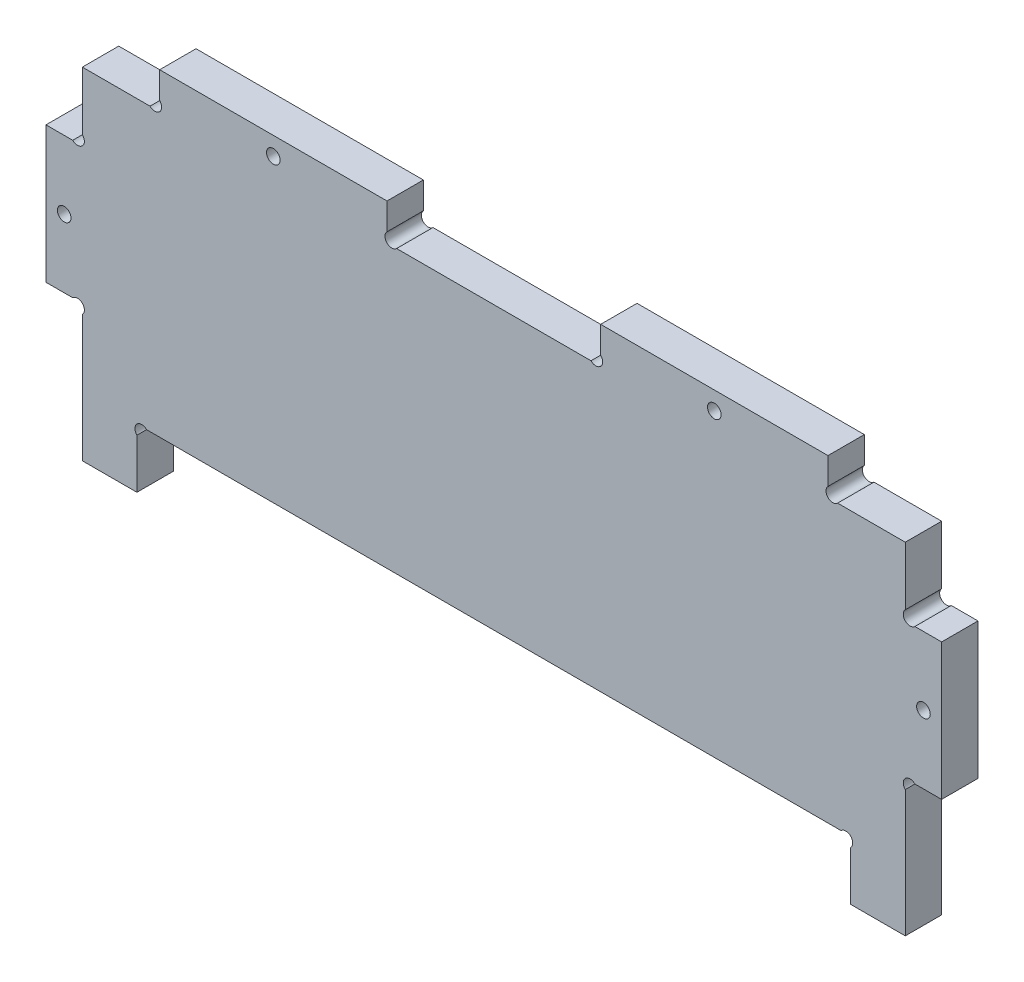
ISO-10303-21;
HEADER;
FILE_DESCRIPTION(('STEP AP214'),'2;1');
FILE_NAME('part.step','',(''),(''),'','','');
FILE_SCHEMA(('AUTOMOTIVE_DESIGN { 1 0 10303 214 1 1 1 1 }'));
ENDSEC;
DATA;
#1=APPLICATION_CONTEXT('core data for automotive mechanical design processes');
#2=APPLICATION_PROTOCOL_DEFINITION('international standard','automotive_design',2000,#1);
#3=PRODUCT_CONTEXT('',#1,'mechanical');
#4=PRODUCT('Part','Part','',(#3));
#5=PRODUCT_RELATED_PRODUCT_CATEGORY('part','',(#4));
#6=PRODUCT_DEFINITION_FORMATION('','',#4);
#7=PRODUCT_DEFINITION_CONTEXT('part definition',#1,'design');
#8=PRODUCT_DEFINITION('design','',#6,#7);
#9=PRODUCT_DEFINITION_SHAPE('','',#8);
#10=(LENGTH_UNIT() NAMED_UNIT(*) SI_UNIT(.MILLI.,.METRE.));
#11=(NAMED_UNIT(*) PLANE_ANGLE_UNIT() SI_UNIT($,.RADIAN.));
#12=(NAMED_UNIT(*) SI_UNIT($,.STERADIAN.) SOLID_ANGLE_UNIT());
#13=UNCERTAINTY_MEASURE_WITH_UNIT(LENGTH_MEASURE(1.E-05),#10,'distance_accuracy_value','');
#14=(GEOMETRIC_REPRESENTATION_CONTEXT(3) GLOBAL_UNCERTAINTY_ASSIGNED_CONTEXT((#13)) GLOBAL_UNIT_ASSIGNED_CONTEXT((#10,
#11,#12)) REPRESENTATION_CONTEXT('',''));
#15=CARTESIAN_POINT('',(0.,0.,0.));
#16=DIRECTION('',(0.,0.,1.));
#17=DIRECTION('',(1.,0.,0.));
#18=AXIS2_PLACEMENT_3D('',#15,#16,#17);
#19=CARTESIAN_POINT('',(146.896258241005,11.5239492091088,8.));
#20=DIRECTION('',(0.,0.,1.));
#21=DIRECTION('',(1.,0.,0.));
#22=AXIS2_PLACEMENT_3D('',#19,#20,#21);
#23=PLANE('',#22);
#24=CARTESIAN_POINT('',(103.835598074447,29.4632890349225,8.));
#25=DIRECTION('',(0.,0.,1.));
#26=DIRECTION('',(1.,0.,0.));
#27=AXIS2_PLACEMENT_3D('',#24,#25,#26);
#28=CIRCLE('',#27,1.5);
#29=CARTESIAN_POINT('',(105.335598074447,29.4632890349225,8.));
#30=VERTEX_POINT('',#29);
#31=EDGE_CURVE('E580',#30,#30,#28,.T.);
#32=ORIENTED_EDGE('',*,*,#31,.F.);
#33=EDGE_LOOP('',(#32));
#34=FACE_BOUND('',#33,.T.);
#35=CARTESIAN_POINT('',(-39.1644019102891,-4.53671096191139,8.));
#36=DIRECTION('',(0.,0.,1.));
#37=DIRECTION('',(-1.,0.,0.));
#38=AXIS2_PLACEMENT_3D('',#35,#36,#37);
#39=CIRCLE('',#38,1.5);
#40=CARTESIAN_POINT('',(-40.6644019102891,-4.53671096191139,8.));
#41=VERTEX_POINT('',#40);
#42=EDGE_CURVE('E289',#41,#41,#39,.T.);
#43=ORIENTED_EDGE('',*,*,#42,.F.);
#44=EDGE_LOOP('',(#43));
#45=FACE_BOUND('',#44,.T.);
#46=CARTESIAN_POINT('',(146.896258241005,11.5239492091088,8.));
#47=DIRECTION('',(0.,0.,-1.));
#48=DIRECTION('',(1.,0.,0.));
#49=AXIS2_PLACEMENT_3D('',#46,#47,#48);
#50=CIRCLE('',#49,1.49999999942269);
#51=CARTESIAN_POINT('',(147.956918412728,10.4632890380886,8.));
#52=VERTEX_POINT('',#51);
#53=CARTESIAN_POINT('',(145.835598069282,12.584609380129,8.));
#54=VERTEX_POINT('',#53);
#55=EDGE_CURVE('E356',#52,#54,#50,.T.);
#56=ORIENTED_EDGE('',*,*,#55,.T.);
#57=DIRECTION('',(0.,1.,0.));
#58=VECTOR('',#57,1.);
#59=CARTESIAN_POINT('',(145.835598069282,12.584609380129,8.));
#60=LINE('',#59,#58);
#61=CARTESIAN_POINT('',(145.835598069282,25.4632890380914,8.));
#62=VERTEX_POINT('',#61);
#63=EDGE_CURVE('E170',#54,#62,#60,.T.);
#64=ORIENTED_EDGE('',*,*,#63,.T.);
#65=DIRECTION('',(-1.,0.,0.));
#66=VECTOR('',#65,1.);
#67=CARTESIAN_POINT('',(130.956918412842,25.4632890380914,8.));
#68=LINE('',#67,#66);
#69=CARTESIAN_POINT('',(130.956918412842,25.4632890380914,8.));
#70=VERTEX_POINT('',#69);
#71=EDGE_CURVE('E449',#62,#70,#68,.T.);
#72=ORIENTED_EDGE('',*,*,#71,.T.);
#73=CARTESIAN_POINT('',(129.896258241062,26.5239492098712,8.));
#74=DIRECTION('',(0.,0.,-1.));
#75=DIRECTION('',(1.,0.,0.));
#76=AXIS2_PLACEMENT_3D('',#73,#74,#75);
#77=CIRCLE('',#76,1.49999999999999);
#78=CARTESIAN_POINT('',(128.835598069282,27.584609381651,8.));
#79=VERTEX_POINT('',#78);
#80=EDGE_CURVE('E468',#70,#79,#77,.T.);
#81=ORIENTED_EDGE('',*,*,#80,.T.);
#82=DIRECTION('',(0.,1.,0.));
#83=VECTOR('',#82,1.);
#84=CARTESIAN_POINT('',(128.835598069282,33.4632890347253,8.));
#85=LINE('',#84,#83);
#86=CARTESIAN_POINT('',(128.835598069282,33.4632890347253,8.));
#87=VERTEX_POINT('',#86);
#88=EDGE_CURVE('E465',#79,#87,#85,.T.);
#89=ORIENTED_EDGE('',*,*,#88,.T.);
#90=DIRECTION('',(-1.,0.,0.));
#91=VECTOR('',#90,1.);
#92=CARTESIAN_POINT('',(78.8355980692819,33.4632890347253,8.));
#93=LINE('',#92,#91);
#94=CARTESIAN_POINT('',(78.8355980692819,33.4632890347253,8.));
#95=VERTEX_POINT('',#94);
#96=EDGE_CURVE('E467',#87,#95,#93,.T.);
#97=ORIENTED_EDGE('',*,*,#96,.T.);
#98=DIRECTION('',(0.,-1.,0.));
#99=VECTOR('',#98,1.);
#100=CARTESIAN_POINT('',(78.8355980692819,27.5846093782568,8.));
#101=LINE('',#100,#99);
#102=CARTESIAN_POINT('',(78.8355980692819,27.5846093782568,8.));
#103=VERTEX_POINT('',#102);
#104=EDGE_CURVE('E470',#95,#103,#101,.T.);
#105=ORIENTED_EDGE('',*,*,#104,.T.);
#106=CARTESIAN_POINT('',(77.7749378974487,26.5239492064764,8.));
#107=DIRECTION('',(0.,0.,-1.));
#108=DIRECTION('',(1.,0.,0.));
#109=AXIS2_PLACEMENT_3D('',#106,#107,#108);
#110=CIRCLE('',#109,1.50000000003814);
#111=CARTESIAN_POINT('',(76.7142777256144,25.4632890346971,8.));
#112=VERTEX_POINT('',#111);
#113=EDGE_CURVE('E476',#103,#112,#110,.T.);
#114=ORIENTED_EDGE('',*,*,#113,.T.);
#115=DIRECTION('',(-1.,0.,0.));
#116=VECTOR('',#115,1.);
#117=CARTESIAN_POINT('',(76.7142777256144,25.4632890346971,8.));
#118=LINE('',#117,#116);
#119=CARTESIAN_POINT('',(33.9569184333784,25.4632890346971,8.));
#120=VERTEX_POINT('',#119);
#121=EDGE_CURVE('E478',#112,#120,#118,.T.);
#122=ORIENTED_EDGE('',*,*,#121,.T.);
#123=CARTESIAN_POINT('',(32.8962582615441,26.5239492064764,8.));
#124=DIRECTION('',(0.,0.,-1.));
#125=DIRECTION('',(-1.,0.,0.));
#126=AXIS2_PLACEMENT_3D('',#123,#124,#125);
#127=CIRCLE('',#126,1.50000000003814);
#128=CARTESIAN_POINT('',(31.8355980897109,27.5846093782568,8.));
#129=VERTEX_POINT('',#128);
#130=EDGE_CURVE('E480',#120,#129,#127,.T.);
#131=ORIENTED_EDGE('',*,*,#130,.T.);
#132=DIRECTION('',(0.,1.,0.));
#133=VECTOR('',#132,1.);
#134=CARTESIAN_POINT('',(31.8355980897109,27.5846093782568,8.));
#135=LINE('',#134,#133);
#136=CARTESIAN_POINT('',(31.8355980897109,33.4632890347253,8.));
#137=VERTEX_POINT('',#136);
#138=EDGE_CURVE('E482',#129,#137,#135,.T.);
#139=ORIENTED_EDGE('',*,*,#138,.T.);
#140=DIRECTION('',(-1.,0.,0.));
#141=VECTOR('',#140,1.);
#142=CARTESIAN_POINT('',(31.8355980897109,33.4632890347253,8.));
#143=LINE('',#142,#141);
#144=CARTESIAN_POINT('',(-18.1644019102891,33.4632890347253,8.));
#145=VERTEX_POINT('',#144);
#146=EDGE_CURVE('E484',#137,#145,#143,.T.);
#147=ORIENTED_EDGE('',*,*,#146,.T.);
#148=DIRECTION('',(0.,-1.,0.));
#149=VECTOR('',#148,1.);
#150=CARTESIAN_POINT('',(-18.1644019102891,33.4632890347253,8.));
#151=LINE('',#150,#149);
#152=CARTESIAN_POINT('',(-18.1644019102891,27.584609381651,8.));
#153=VERTEX_POINT('',#152);
#154=EDGE_CURVE('E486',#145,#153,#151,.T.);
#155=ORIENTED_EDGE('',*,*,#154,.T.);
#156=CARTESIAN_POINT('',(-19.2250620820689,26.5239492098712,8.));
#157=DIRECTION('',(0.,0.,-1.));
#158=DIRECTION('',(1.,0.,0.));
#159=AXIS2_PLACEMENT_3D('',#156,#157,#158);
#160=CIRCLE('',#159,1.50000000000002);
#161=CARTESIAN_POINT('',(-20.2857222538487,25.4632890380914,8.));
#162=VERTEX_POINT('',#161);
#163=EDGE_CURVE('E488',#153,#162,#160,.T.);
#164=ORIENTED_EDGE('',*,*,#163,.T.);
#165=DIRECTION('',(-1.,0.,0.));
#166=VECTOR('',#165,1.);
#167=CARTESIAN_POINT('',(-20.2857222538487,25.4632890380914,8.));
#168=LINE('',#167,#166);
#169=CARTESIAN_POINT('',(-35.1644019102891,25.4632890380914,8.));
#170=VERTEX_POINT('',#169);
#171=EDGE_CURVE('E490',#162,#170,#168,.T.);
#172=ORIENTED_EDGE('',*,*,#171,.T.);
#173=DIRECTION('',(0.,-1.,0.));
#174=VECTOR('',#173,1.);
#175=CARTESIAN_POINT('',(-35.1644019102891,13.0239492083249,8.));
#176=LINE('',#175,#174);
#177=CARTESIAN_POINT('',(-35.1644019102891,12.584609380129,8.));
#178=VERTEX_POINT('',#177);
#179=EDGE_CURVE('E492',#170,#178,#176,.T.);
#180=ORIENTED_EDGE('',*,*,#179,.T.);
#181=CARTESIAN_POINT('',(-36.2250620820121,11.5239492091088,8.));
#182=DIRECTION('',(0.,0.,-1.));
#183=DIRECTION('',(-1.,0.,0.));
#184=AXIS2_PLACEMENT_3D('',#181,#182,#183);
#185=CIRCLE('',#184,1.49999999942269);
#186=CARTESIAN_POINT('',(-37.2857222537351,10.4632890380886,8.));
#187=VERTEX_POINT('',#186);
#188=EDGE_CURVE('E494',#178,#187,#185,.T.);
#189=ORIENTED_EDGE('',*,*,#188,.T.);
#190=DIRECTION('',(-1.,0.,0.));
#191=VECTOR('',#190,1.);
#192=CARTESIAN_POINT('',(-43.1644019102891,10.4632890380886,8.));
#193=LINE('',#192,#191);
#194=CARTESIAN_POINT('',(-43.1644019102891,10.4632890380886,8.));
#195=VERTEX_POINT('',#194);
#196=EDGE_CURVE('E496',#187,#195,#193,.T.);
#197=ORIENTED_EDGE('',*,*,#196,.T.);
#198=DIRECTION('',(0.,-1.,0.));
#199=VECTOR('',#198,1.);
#200=CARTESIAN_POINT('',(-43.1644019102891,-19.5367109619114,8.));
#201=LINE('',#200,#199);
#202=CARTESIAN_POINT('',(-43.1644019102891,-19.5367109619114,8.));
#203=VERTEX_POINT('',#202);
#204=EDGE_CURVE('E498',#195,#203,#201,.T.);
#205=ORIENTED_EDGE('',*,*,#204,.T.);
#206=DIRECTION('',(1.,0.,0.));
#207=VECTOR('',#206,1.);
#208=CARTESIAN_POINT('',(-37.2857222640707,-19.5367109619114,8.));
#209=LINE('',#208,#207);
#210=CARTESIAN_POINT('',(-37.2857222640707,-19.5367109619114,8.));
#211=VERTEX_POINT('',#210);
#212=EDGE_CURVE('E500',#203,#211,#209,.T.);
#213=ORIENTED_EDGE('',*,*,#212,.T.);
#214=CARTESIAN_POINT('',(-36.2250620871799,-20.597371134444,8.));
#215=DIRECTION('',(0.,0.,-1.));
#216=DIRECTION('',(-1.,0.,0.));
#217=AXIS2_PLACEMENT_3D('',#214,#215,#216);
#218=CIRCLE('',#217,1.5000000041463);
#219=CARTESIAN_POINT('',(-35.1644019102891,-21.6580313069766,8.));
#220=VERTEX_POINT('',#219);
#221=EDGE_CURVE('E502',#211,#220,#218,.T.);
#222=ORIENTED_EDGE('',*,*,#221,.T.);
#223=DIRECTION('',(0.,-1.,0.));
#224=VECTOR('',#223,1.);
#225=CARTESIAN_POINT('',(-35.1644019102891,-22.097371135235,8.));
#226=LINE('',#225,#224);
#227=CARTESIAN_POINT('',(-35.1644019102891,-49.5367109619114,8.));
#228=VERTEX_POINT('',#227);
#229=EDGE_CURVE('E504',#220,#228,#226,.T.);
#230=ORIENTED_EDGE('',*,*,#229,.T.);
#231=DIRECTION('',(1.,0.,0.));
#232=VECTOR('',#231,1.);
#233=CARTESIAN_POINT('',(-35.1644019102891,-49.5367109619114,8.));
#234=LINE('',#233,#232);
#235=CARTESIAN_POINT('',(-23.164401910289,-49.5367109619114,8.));
#236=VERTEX_POINT('',#235);
#237=EDGE_CURVE('E506',#228,#236,#234,.T.);
#238=ORIENTED_EDGE('',*,*,#237,.T.);
#239=DIRECTION('',(0.,1.,0.));
#240=VECTOR('',#239,1.);
#241=CARTESIAN_POINT('',(-23.164401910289,-49.5367109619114,8.));
#242=LINE('',#241,#240);
#243=CARTESIAN_POINT('',(-23.164401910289,-38.658031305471,8.));
#244=VERTEX_POINT('',#243);
#245=EDGE_CURVE('E508',#236,#244,#242,.T.);
#246=ORIENTED_EDGE('',*,*,#245,.T.);
#247=CARTESIAN_POINT('',(-22.1037417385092,-37.5973711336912,8.));
#248=DIRECTION('',(0.,0.,-1.));
#249=DIRECTION('',(1.,0.,0.));
#250=AXIS2_PLACEMENT_3D('',#247,#248,#249);
#251=CIRCLE('',#250,1.5);
#252=CARTESIAN_POINT('',(-21.0430815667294,-36.5367109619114,8.));
#253=VERTEX_POINT('',#252);
#254=EDGE_CURVE('E510',#244,#253,#251,.T.);
#255=ORIENTED_EDGE('',*,*,#254,.T.);
#256=DIRECTION('',(1.,0.,0.));
#257=VECTOR('',#256,1.);
#258=CARTESIAN_POINT('',(-21.0430815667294,-36.5367109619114,8.));
#259=LINE('',#258,#257);
#260=CARTESIAN_POINT('',(131.714277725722,-36.5367109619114,8.));
#261=VERTEX_POINT('',#260);
#262=EDGE_CURVE('E512',#253,#261,#259,.T.);
#263=ORIENTED_EDGE('',*,*,#262,.T.);
#264=CARTESIAN_POINT('',(132.774937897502,-37.5973711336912,8.));
#265=DIRECTION('',(0.,0.,-1.));
#266=DIRECTION('',(1.,0.,0.));
#267=AXIS2_PLACEMENT_3D('',#264,#265,#266);
#268=CIRCLE('',#267,1.5);
#269=CARTESIAN_POINT('',(133.835598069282,-38.658031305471,8.));
#270=VERTEX_POINT('',#269);
#271=EDGE_CURVE('E514',#261,#270,#268,.T.);
#272=ORIENTED_EDGE('',*,*,#271,.T.);
#273=DIRECTION('',(0.,-1.,0.));
#274=VECTOR('',#273,1.);
#275=CARTESIAN_POINT('',(133.835598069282,-49.5367109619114,8.));
#276=LINE('',#275,#274);
#277=CARTESIAN_POINT('',(133.835598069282,-49.5367109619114,8.));
#278=VERTEX_POINT('',#277);
#279=EDGE_CURVE('E516',#270,#278,#276,.T.);
#280=ORIENTED_EDGE('',*,*,#279,.T.);
#281=DIRECTION('',(1.,0.,0.));
#282=VECTOR('',#281,1.);
#283=CARTESIAN_POINT('',(145.835598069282,-49.5367109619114,8.));
#284=LINE('',#283,#282);
#285=CARTESIAN_POINT('',(145.835598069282,-49.5367109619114,8.));
#286=VERTEX_POINT('',#285);
#287=EDGE_CURVE('E518',#278,#286,#284,.T.);
#288=ORIENTED_EDGE('',*,*,#287,.T.);
#289=DIRECTION('',(0.,1.,0.));
#290=VECTOR('',#289,1.);
#291=CARTESIAN_POINT('',(145.835598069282,-36.5367109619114,8.));
#292=LINE('',#291,#290);
#293=CARTESIAN_POINT('',(145.835598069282,-21.6580313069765,8.));
#294=VERTEX_POINT('',#293);
#295=EDGE_CURVE('E520',#286,#294,#292,.T.);
#296=ORIENTED_EDGE('',*,*,#295,.T.);
#297=CARTESIAN_POINT('',(146.896258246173,-20.5973711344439,8.));
#298=DIRECTION('',(0.,0.,-1.));
#299=DIRECTION('',(1.,0.,0.));
#300=AXIS2_PLACEMENT_3D('',#297,#298,#299);
#301=CIRCLE('',#300,1.5000000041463);
#302=CARTESIAN_POINT('',(147.956918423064,-19.5367109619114,8.));
#303=VERTEX_POINT('',#302);
#304=EDGE_CURVE('E267',#294,#303,#301,.T.);
#305=ORIENTED_EDGE('',*,*,#304,.T.);
#306=DIRECTION('',(1.,0.,0.));
#307=VECTOR('',#306,1.);
#308=CARTESIAN_POINT('',(147.956918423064,-19.5367109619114,8.));
#309=LINE('',#308,#307);
#310=CARTESIAN_POINT('',(153.835598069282,-19.5367109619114,8.));
#311=VERTEX_POINT('',#310);
#312=EDGE_CURVE('E261',#303,#311,#309,.T.);
#313=ORIENTED_EDGE('',*,*,#312,.T.);
#314=DIRECTION('',(0.,1.,0.));
#315=VECTOR('',#314,1.);
#316=CARTESIAN_POINT('',(153.835598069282,-19.5367109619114,8.));
#317=LINE('',#316,#315);
#318=CARTESIAN_POINT('',(153.835598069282,10.4632890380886,8.));
#319=VERTEX_POINT('',#318);
#320=EDGE_CURVE('E265',#311,#319,#317,.T.);
#321=ORIENTED_EDGE('',*,*,#320,.T.);
#322=DIRECTION('',(-1.,0.,0.));
#323=VECTOR('',#322,1.);
#324=CARTESIAN_POINT('',(153.835598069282,10.4632890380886,8.));
#325=LINE('',#324,#323);
#326=EDGE_CURVE('E49',#319,#52,#325,.T.);
#327=ORIENTED_EDGE('',*,*,#326,.T.);
#328=EDGE_LOOP('',(#56,#64,#72,#81,#89,#97,#105,#114,#122,#131,#139,#147,#155,#164,#172,#180,
#189,#197,#205,#213,#222,#230,#238,#246,#255,#263,#272,#280,#288,#296,#305,#313,#321,#327));
#329=FACE_BOUND('',#328,.T.);
#330=CARTESIAN_POINT('',(6.83559808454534,29.4632890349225,8.));
#331=DIRECTION('',(0.,0.,1.));
#332=DIRECTION('',(-1.,0.,0.));
#333=AXIS2_PLACEMENT_3D('',#330,#331,#332);
#334=CIRCLE('',#333,1.5);
#335=CARTESIAN_POINT('',(5.33559808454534,29.4632890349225,8.));
#336=VERTEX_POINT('',#335);
#337=EDGE_CURVE('E586',#336,#336,#334,.T.);
#338=ORIENTED_EDGE('',*,*,#337,.F.);
#339=EDGE_LOOP('',(#338));
#340=FACE_BOUND('',#339,.T.);
#341=CARTESIAN_POINT('',(149.835598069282,-4.53671096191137,8.));
#342=DIRECTION('',(0.,0.,1.));
#343=DIRECTION('',(1.,0.,0.));
#344=AXIS2_PLACEMENT_3D('',#341,#342,#343);
#345=CIRCLE('',#344,1.5);
#346=CARTESIAN_POINT('',(151.335598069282,-4.53671096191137,8.));
#347=VERTEX_POINT('',#346);
#348=EDGE_CURVE('E571',#347,#347,#345,.T.);
#349=ORIENTED_EDGE('',*,*,#348,.F.);
#350=EDGE_LOOP('',(#349));
#351=FACE_BOUND('',#350,.T.);
#352=ADVANCED_FACE('F32',(#34,#45,#329,#340,#351),#23,.T.);
#353=CARTESIAN_POINT('',(146.896258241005,11.5239492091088,0.));
#354=DIRECTION('',(0.,0.,1.));
#355=DIRECTION('',(1.,0.,0.));
#356=AXIS2_PLACEMENT_3D('',#353,#354,#355);
#357=PLANE('',#356);
#358=CARTESIAN_POINT('',(103.835598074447,29.4632890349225,0.));
#359=DIRECTION('',(0.,0.,1.));
#360=DIRECTION('',(1.,0.,0.));
#361=AXIS2_PLACEMENT_3D('',#358,#359,#360);
#362=CIRCLE('',#361,1.5);
#363=CARTESIAN_POINT('',(105.335598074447,29.4632890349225,0.));
#364=VERTEX_POINT('',#363);
#365=EDGE_CURVE('E577',#364,#364,#362,.T.);
#366=ORIENTED_EDGE('',*,*,#365,.T.);
#367=EDGE_LOOP('',(#366));
#368=FACE_BOUND('',#367,.T.);
#369=CARTESIAN_POINT('',(-39.1644019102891,-4.53671096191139,0.));
#370=DIRECTION('',(0.,0.,1.));
#371=DIRECTION('',(-1.,0.,0.));
#372=AXIS2_PLACEMENT_3D('',#369,#370,#371);
#373=CIRCLE('',#372,1.5);
#374=CARTESIAN_POINT('',(-40.6644019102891,-4.53671096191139,0.));
#375=VERTEX_POINT('',#374);
#376=EDGE_CURVE('E589',#375,#375,#373,.T.);
#377=ORIENTED_EDGE('',*,*,#376,.T.);
#378=EDGE_LOOP('',(#377));
#379=FACE_BOUND('',#378,.T.);
#380=CARTESIAN_POINT('',(146.896258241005,11.5239492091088,0.));
#381=DIRECTION('',(0.,0.,-1.));
#382=DIRECTION('',(1.,0.,0.));
#383=AXIS2_PLACEMENT_3D('',#380,#381,#382);
#384=CIRCLE('',#383,1.49999999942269);
#385=CARTESIAN_POINT('',(147.956918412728,10.4632890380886,0.));
#386=VERTEX_POINT('',#385);
#387=CARTESIAN_POINT('',(145.835598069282,12.584609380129,0.));
#388=VERTEX_POINT('',#387);
#389=EDGE_CURVE('E285',#386,#388,#384,.T.);
#390=ORIENTED_EDGE('',*,*,#389,.F.);
#391=DIRECTION('',(-1.,0.,0.));
#392=VECTOR('',#391,1.);
#393=CARTESIAN_POINT('',(153.835598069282,10.4632890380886,0.));
#394=LINE('',#393,#392);
#395=CARTESIAN_POINT('',(153.835598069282,10.4632890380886,0.));
#396=VERTEX_POINT('',#395);
#397=EDGE_CURVE('E162',#396,#386,#394,.T.);
#398=ORIENTED_EDGE('',*,*,#397,.F.);
#399=DIRECTION('',(0.,1.,0.));
#400=VECTOR('',#399,1.);
#401=CARTESIAN_POINT('',(153.835598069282,-19.5367109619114,0.));
#402=LINE('',#401,#400);
#403=CARTESIAN_POINT('',(153.835598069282,-19.5367109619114,0.));
#404=VERTEX_POINT('',#403);
#405=EDGE_CURVE('E156',#404,#396,#402,.T.);
#406=ORIENTED_EDGE('',*,*,#405,.F.);
#407=DIRECTION('',(1.,0.,0.));
#408=VECTOR('',#407,1.);
#409=CARTESIAN_POINT('',(147.956918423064,-19.5367109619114,0.));
#410=LINE('',#409,#408);
#411=CARTESIAN_POINT('',(147.956918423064,-19.5367109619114,0.));
#412=VERTEX_POINT('',#411);
#413=EDGE_CURVE('E275',#412,#404,#410,.T.);
#414=ORIENTED_EDGE('',*,*,#413,.F.);
#415=CARTESIAN_POINT('',(146.896258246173,-20.5973711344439,0.));
#416=DIRECTION('',(0.,0.,-1.));
#417=DIRECTION('',(1.,0.,0.));
#418=AXIS2_PLACEMENT_3D('',#415,#416,#417);
#419=CIRCLE('',#418,1.5000000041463);
#420=CARTESIAN_POINT('',(145.835598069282,-21.6580313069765,0.));
#421=VERTEX_POINT('',#420);
#422=EDGE_CURVE('E351',#421,#412,#419,.T.);
#423=ORIENTED_EDGE('',*,*,#422,.F.);
#424=DIRECTION('',(0.,1.,0.));
#425=VECTOR('',#424,1.);
#426=CARTESIAN_POINT('',(145.835598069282,-22.0973711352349,0.));
#427=LINE('',#426,#425);
#428=CARTESIAN_POINT('',(145.835598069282,-49.5367109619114,0.));
#429=VERTEX_POINT('',#428);
#430=EDGE_CURVE('E349',#429,#421,#427,.T.);
#431=ORIENTED_EDGE('',*,*,#430,.F.);
#432=DIRECTION('',(1.,0.,0.));
#433=VECTOR('',#432,1.);
#434=CARTESIAN_POINT('',(145.835598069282,-49.5367109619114,0.));
#435=LINE('',#434,#433);
#436=CARTESIAN_POINT('',(133.835598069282,-49.5367109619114,0.));
#437=VERTEX_POINT('',#436);
#438=EDGE_CURVE('E346',#437,#429,#435,.T.);
#439=ORIENTED_EDGE('',*,*,#438,.F.);
#440=DIRECTION('',(0.,-1.,0.));
#441=VECTOR('',#440,1.);
#442=CARTESIAN_POINT('',(133.835598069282,-49.5367109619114,0.));
#443=LINE('',#442,#441);
#444=CARTESIAN_POINT('',(133.835598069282,-38.658031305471,0.));
#445=VERTEX_POINT('',#444);
#446=EDGE_CURVE('E344',#445,#437,#443,.T.);
#447=ORIENTED_EDGE('',*,*,#446,.F.);
#448=CARTESIAN_POINT('',(132.774937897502,-37.5973711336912,0.));
#449=DIRECTION('',(0.,0.,-1.));
#450=DIRECTION('',(1.,0.,0.));
#451=AXIS2_PLACEMENT_3D('',#448,#449,#450);
#452=CIRCLE('',#451,1.5);
#453=CARTESIAN_POINT('',(131.714277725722,-36.5367109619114,0.));
#454=VERTEX_POINT('',#453);
#455=EDGE_CURVE('E342',#454,#445,#452,.T.);
#456=ORIENTED_EDGE('',*,*,#455,.F.);
#457=DIRECTION('',(1.,0.,0.));
#458=VECTOR('',#457,1.);
#459=CARTESIAN_POINT('',(24.7142777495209,-36.5367109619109,0.));
#460=LINE('',#459,#458);
#461=CARTESIAN_POINT('',(-21.0430815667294,-36.5367109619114,0.));
#462=VERTEX_POINT('',#461);
#463=EDGE_CURVE('E340',#462,#454,#460,.T.);
#464=ORIENTED_EDGE('',*,*,#463,.F.);
#465=CARTESIAN_POINT('',(-22.1037417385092,-37.5973711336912,0.));
#466=DIRECTION('',(0.,0.,-1.));
#467=DIRECTION('',(1.,0.,0.));
#468=AXIS2_PLACEMENT_3D('',#465,#466,#467);
#469=CIRCLE('',#468,1.5);
#470=CARTESIAN_POINT('',(-23.164401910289,-38.658031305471,0.));
#471=VERTEX_POINT('',#470);
#472=EDGE_CURVE('E337',#471,#462,#469,.T.);
#473=ORIENTED_EDGE('',*,*,#472,.F.);
#474=DIRECTION('',(0.,1.,0.));
#475=VECTOR('',#474,1.);
#476=CARTESIAN_POINT('',(-23.164401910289,-49.5367109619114,0.));
#477=LINE('',#476,#475);
#478=CARTESIAN_POINT('',(-23.164401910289,-49.5367109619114,0.));
#479=VERTEX_POINT('',#478);
#480=EDGE_CURVE('E335',#479,#471,#477,.T.);
#481=ORIENTED_EDGE('',*,*,#480,.F.);
#482=DIRECTION('',(1.,0.,0.));
#483=VECTOR('',#482,1.);
#484=CARTESIAN_POINT('',(-35.1644019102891,-49.5367109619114,0.));
#485=LINE('',#484,#483);
#486=CARTESIAN_POINT('',(-35.1644019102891,-49.5367109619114,0.));
#487=VERTEX_POINT('',#486);
#488=EDGE_CURVE('E333',#487,#479,#485,.T.);
#489=ORIENTED_EDGE('',*,*,#488,.F.);
#490=DIRECTION('',(0.,-1.,0.));
#491=VECTOR('',#490,1.);
#492=CARTESIAN_POINT('',(-35.1644019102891,-36.5367109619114,0.));
#493=LINE('',#492,#491);
#494=CARTESIAN_POINT('',(-35.1644019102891,-21.6580313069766,0.));
#495=VERTEX_POINT('',#494);
#496=EDGE_CURVE('E331',#495,#487,#493,.T.);
#497=ORIENTED_EDGE('',*,*,#496,.F.);
#498=CARTESIAN_POINT('',(-36.2250620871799,-20.597371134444,0.));
#499=DIRECTION('',(0.,0.,-1.));
#500=DIRECTION('',(-1.,0.,0.));
#501=AXIS2_PLACEMENT_3D('',#498,#499,#500);
#502=CIRCLE('',#501,1.5000000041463);
#503=CARTESIAN_POINT('',(-37.2857222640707,-19.5367109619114,0.));
#504=VERTEX_POINT('',#503);
#505=EDGE_CURVE('E328',#504,#495,#502,.T.);
#506=ORIENTED_EDGE('',*,*,#505,.F.);
#507=DIRECTION('',(1.,0.,0.));
#508=VECTOR('',#507,1.);
#509=CARTESIAN_POINT('',(-37.2857222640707,-19.5367109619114,0.));
#510=LINE('',#509,#508);
#511=CARTESIAN_POINT('',(-43.1644019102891,-19.5367109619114,0.));
#512=VERTEX_POINT('',#511);
#513=EDGE_CURVE('E326',#512,#504,#510,.T.);
#514=ORIENTED_EDGE('',*,*,#513,.F.);
#515=DIRECTION('',(0.,-1.,0.));
#516=VECTOR('',#515,1.);
#517=CARTESIAN_POINT('',(-43.1644019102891,-19.5367109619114,0.));
#518=LINE('',#517,#516);
#519=CARTESIAN_POINT('',(-43.1644019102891,10.4632890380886,0.));
#520=VERTEX_POINT('',#519);
#521=EDGE_CURVE('E324',#520,#512,#518,.T.);
#522=ORIENTED_EDGE('',*,*,#521,.F.);
#523=DIRECTION('',(-1.,0.,0.));
#524=VECTOR('',#523,1.);
#525=CARTESIAN_POINT('',(-43.1644019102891,10.4632890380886,0.));
#526=LINE('',#525,#524);
#527=CARTESIAN_POINT('',(-37.2857222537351,10.4632890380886,0.));
#528=VERTEX_POINT('',#527);
#529=EDGE_CURVE('E322',#528,#520,#526,.T.);
#530=ORIENTED_EDGE('',*,*,#529,.F.);
#531=CARTESIAN_POINT('',(-36.2250620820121,11.5239492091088,0.));
#532=DIRECTION('',(0.,0.,-1.));
#533=DIRECTION('',(-1.,0.,0.));
#534=AXIS2_PLACEMENT_3D('',#531,#532,#533);
#535=CIRCLE('',#534,1.49999999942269);
#536=CARTESIAN_POINT('',(-35.1644019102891,12.584609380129,0.));
#537=VERTEX_POINT('',#536);
#538=EDGE_CURVE('E320',#537,#528,#535,.T.);
#539=ORIENTED_EDGE('',*,*,#538,.F.);
#540=DIRECTION('',(0.,-1.,0.));
#541=VECTOR('',#540,1.);
#542=CARTESIAN_POINT('',(-35.1644019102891,12.584609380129,0.));
#543=LINE('',#542,#541);
#544=CARTESIAN_POINT('',(-35.1644019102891,25.4632890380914,0.));
#545=VERTEX_POINT('',#544);
#546=EDGE_CURVE('E318',#545,#537,#543,.T.);
#547=ORIENTED_EDGE('',*,*,#546,.F.);
#548=DIRECTION('',(-1.,0.,0.));
#549=VECTOR('',#548,1.);
#550=CARTESIAN_POINT('',(-20.2857222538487,25.4632890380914,0.));
#551=LINE('',#550,#549);
#552=CARTESIAN_POINT('',(-20.2857222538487,25.4632890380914,0.));
#553=VERTEX_POINT('',#552);
#554=EDGE_CURVE('E315',#553,#545,#551,.T.);
#555=ORIENTED_EDGE('',*,*,#554,.F.);
#556=CARTESIAN_POINT('',(-19.2250620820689,26.5239492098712,0.));
#557=DIRECTION('',(0.,0.,-1.));
#558=DIRECTION('',(1.,0.,0.));
#559=AXIS2_PLACEMENT_3D('',#556,#557,#558);
#560=CIRCLE('',#559,1.50000000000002);
#561=CARTESIAN_POINT('',(-18.1644019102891,27.584609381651,0.));
#562=VERTEX_POINT('',#561);
#563=EDGE_CURVE('E313',#562,#553,#560,.T.);
#564=ORIENTED_EDGE('',*,*,#563,.F.);
#565=DIRECTION('',(0.,-1.,0.));
#566=VECTOR('',#565,1.);
#567=CARTESIAN_POINT('',(-18.1644019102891,33.4632890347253,0.));
#568=LINE('',#567,#566);
#569=CARTESIAN_POINT('',(-18.1644019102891,33.4632890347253,0.));
#570=VERTEX_POINT('',#569);
#571=EDGE_CURVE('E311',#570,#562,#568,.T.);
#572=ORIENTED_EDGE('',*,*,#571,.F.);
#573=DIRECTION('',(-1.,0.,0.));
#574=VECTOR('',#573,1.);
#575=CARTESIAN_POINT('',(31.8355980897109,33.4632890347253,0.));
#576=LINE('',#575,#574);
#577=CARTESIAN_POINT('',(31.8355980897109,33.4632890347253,0.));
#578=VERTEX_POINT('',#577);
#579=EDGE_CURVE('E309',#578,#570,#576,.T.);
#580=ORIENTED_EDGE('',*,*,#579,.F.);
#581=DIRECTION('',(0.,1.,0.));
#582=VECTOR('',#581,1.);
#583=CARTESIAN_POINT('',(31.8355980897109,27.5846093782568,0.));
#584=LINE('',#583,#582);
#585=CARTESIAN_POINT('',(31.8355980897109,27.5846093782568,0.));
#586=VERTEX_POINT('',#585);
#587=EDGE_CURVE('E307',#586,#578,#584,.T.);
#588=ORIENTED_EDGE('',*,*,#587,.F.);
#589=CARTESIAN_POINT('',(32.8962582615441,26.5239492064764,0.));
#590=DIRECTION('',(0.,0.,-1.));
#591=DIRECTION('',(-1.,0.,0.));
#592=AXIS2_PLACEMENT_3D('',#589,#590,#591);
#593=CIRCLE('',#592,1.50000000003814);
#594=CARTESIAN_POINT('',(33.9569184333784,25.4632890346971,0.));
#595=VERTEX_POINT('',#594);
#596=EDGE_CURVE('E305',#595,#586,#593,.T.);
#597=ORIENTED_EDGE('',*,*,#596,.F.);
#598=DIRECTION('',(-1.,0.,0.));
#599=VECTOR('',#598,1.);
#600=CARTESIAN_POINT('',(76.7142777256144,25.4632890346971,0.));
#601=LINE('',#600,#599);
#602=CARTESIAN_POINT('',(76.7142777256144,25.4632890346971,0.));
#603=VERTEX_POINT('',#602);
#604=EDGE_CURVE('E303',#603,#595,#601,.T.);
#605=ORIENTED_EDGE('',*,*,#604,.F.);
#606=CARTESIAN_POINT('',(77.7749378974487,26.5239492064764,0.));
#607=DIRECTION('',(0.,0.,-1.));
#608=DIRECTION('',(1.,0.,0.));
#609=AXIS2_PLACEMENT_3D('',#606,#607,#608);
#610=CIRCLE('',#609,1.50000000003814);
#611=CARTESIAN_POINT('',(78.8355980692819,27.5846093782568,0.));
#612=VERTEX_POINT('',#611);
#613=EDGE_CURVE('E301',#612,#603,#610,.T.);
#614=ORIENTED_EDGE('',*,*,#613,.F.);
#615=DIRECTION('',(0.,-1.,0.));
#616=VECTOR('',#615,1.);
#617=CARTESIAN_POINT('',(78.8355980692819,27.5846093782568,0.));
#618=LINE('',#617,#616);
#619=CARTESIAN_POINT('',(78.8355980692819,33.4632890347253,0.));
#620=VERTEX_POINT('',#619);
#621=EDGE_CURVE('E299',#620,#612,#618,.T.);
#622=ORIENTED_EDGE('',*,*,#621,.F.);
#623=DIRECTION('',(-1.,0.,0.));
#624=VECTOR('',#623,1.);
#625=CARTESIAN_POINT('',(78.8355980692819,33.4632890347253,0.));
#626=LINE('',#625,#624);
#627=CARTESIAN_POINT('',(128.835598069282,33.4632890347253,0.));
#628=VERTEX_POINT('',#627);
#629=EDGE_CURVE('E297',#628,#620,#626,.T.);
#630=ORIENTED_EDGE('',*,*,#629,.F.);
#631=DIRECTION('',(0.,1.,0.));
#632=VECTOR('',#631,1.);
#633=CARTESIAN_POINT('',(128.835598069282,33.4632890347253,0.));
#634=LINE('',#633,#632);
#635=CARTESIAN_POINT('',(128.835598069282,27.584609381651,0.));
#636=VERTEX_POINT('',#635);
#637=EDGE_CURVE('E295',#636,#628,#634,.T.);
#638=ORIENTED_EDGE('',*,*,#637,.F.);
#639=CARTESIAN_POINT('',(129.896258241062,26.5239492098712,0.));
#640=DIRECTION('',(0.,0.,-1.));
#641=DIRECTION('',(1.,0.,0.));
#642=AXIS2_PLACEMENT_3D('',#639,#640,#641);
#643=CIRCLE('',#642,1.49999999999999);
#644=CARTESIAN_POINT('',(130.956918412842,25.4632890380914,0.));
#645=VERTEX_POINT('',#644);
#646=EDGE_CURVE('E293',#645,#636,#643,.T.);
#647=ORIENTED_EDGE('',*,*,#646,.F.);
#648=DIRECTION('',(-1.,0.,0.));
#649=VECTOR('',#648,1.);
#650=CARTESIAN_POINT('',(130.956918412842,25.4632890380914,0.));
#651=LINE('',#650,#649);
#652=CARTESIAN_POINT('',(145.835598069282,25.4632890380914,0.));
#653=VERTEX_POINT('',#652);
#654=EDGE_CURVE('E291',#653,#645,#651,.T.);
#655=ORIENTED_EDGE('',*,*,#654,.F.);
#656=DIRECTION('',(0.,1.,0.));
#657=VECTOR('',#656,1.);
#658=CARTESIAN_POINT('',(145.835598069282,13.0239492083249,0.));
#659=LINE('',#658,#657);
#660=EDGE_CURVE('E288',#388,#653,#659,.T.);
#661=ORIENTED_EDGE('',*,*,#660,.F.);
#662=EDGE_LOOP('',(#390,#398,#406,#414,#423,#431,#439,#447,#456,#464,#473,#481,#489,#497,#506,
#514,#522,#530,#539,#547,#555,#564,#572,#580,#588,#597,#605,#614,#622,#630,#638,#647,#655,#661));
#663=FACE_BOUND('',#662,.T.);
#664=CARTESIAN_POINT('',(6.83559808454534,29.4632890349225,0.));
#665=DIRECTION('',(0.,0.,1.));
#666=DIRECTION('',(-1.,0.,0.));
#667=AXIS2_PLACEMENT_3D('',#664,#665,#666);
#668=CIRCLE('',#667,1.5);
#669=CARTESIAN_POINT('',(5.33559808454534,29.4632890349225,0.));
#670=VERTEX_POINT('',#669);
#671=EDGE_CURVE('E583',#670,#670,#668,.T.);
#672=ORIENTED_EDGE('',*,*,#671,.T.);
#673=EDGE_LOOP('',(#672));
#674=FACE_BOUND('',#673,.T.);
#675=CARTESIAN_POINT('',(149.835598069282,-4.53671096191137,0.));
#676=DIRECTION('',(0.,0.,1.));
#677=DIRECTION('',(1.,0.,0.));
#678=AXIS2_PLACEMENT_3D('',#675,#676,#677);
#679=CIRCLE('',#678,1.5);
#680=CARTESIAN_POINT('',(151.335598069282,-4.53671096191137,0.));
#681=VERTEX_POINT('',#680);
#682=EDGE_CURVE('E574',#681,#681,#679,.T.);
#683=ORIENTED_EDGE('',*,*,#682,.T.);
#684=EDGE_LOOP('',(#683));
#685=FACE_BOUND('',#684,.T.);
#686=ADVANCED_FACE('F453',(#368,#379,#663,#674,#685),#357,.F.);
#687=CARTESIAN_POINT('',(146.896258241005,11.5239492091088,8.));
#688=DIRECTION('',(0.,0.,-1.));
#689=DIRECTION('',(-1.,0.,0.));
#690=AXIS2_PLACEMENT_3D('',#687,#688,#689);
#691=CYLINDRICAL_SURFACE('',#690,1.49999999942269);
#692=ORIENTED_EDGE('',*,*,#389,.T.);
#693=DIRECTION('',(0.,0.,-1.));
#694=VECTOR('',#693,1.);
#695=CARTESIAN_POINT('',(145.835598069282,12.584609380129,8.));
#696=LINE('',#695,#694);
#697=EDGE_CURVE('E11',#54,#388,#696,.T.);
#698=ORIENTED_EDGE('',*,*,#697,.F.);
#699=ORIENTED_EDGE('',*,*,#55,.F.);
#700=DIRECTION('',(0.,0.,-1.));
#701=VECTOR('',#700,1.);
#702=CARTESIAN_POINT('',(147.956918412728,10.4632890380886,8.));
#703=LINE('',#702,#701);
#704=EDGE_CURVE('E281',#52,#386,#703,.T.);
#705=ORIENTED_EDGE('',*,*,#704,.T.);
#706=EDGE_LOOP('',(#692,#698,#699,#705));
#707=FACE_BOUND('',#706,.T.);
#708=ADVANCED_FACE('F34',(#707),#691,.F.);
#709=CARTESIAN_POINT('',(145.835598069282,13.0239492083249,8.));
#710=DIRECTION('',(-1.,0.,0.));
#711=DIRECTION('',(0.,0.,1.));
#712=AXIS2_PLACEMENT_3D('',#709,#710,#711);
#713=PLANE('',#712);
#714=ORIENTED_EDGE('',*,*,#660,.T.);
#715=DIRECTION('',(0.,0.,-1.));
#716=VECTOR('',#715,1.);
#717=CARTESIAN_POINT('',(145.835598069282,25.4632890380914,8.));
#718=LINE('',#717,#716);
#719=EDGE_CURVE('E41',#62,#653,#718,.T.);
#720=ORIENTED_EDGE('',*,*,#719,.F.);
#721=ORIENTED_EDGE('',*,*,#63,.F.);
#722=ORIENTED_EDGE('',*,*,#697,.T.);
#723=EDGE_LOOP('',(#714,#720,#721,#722));
#724=FACE_BOUND('',#723,.T.);
#725=ADVANCED_FACE('F924',(#724),#713,.F.);
#726=CARTESIAN_POINT('',(130.956918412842,25.4632890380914,8.));
#727=DIRECTION('',(0.,-1.,0.));
#728=DIRECTION('',(0.,0.,-1.));
#729=AXIS2_PLACEMENT_3D('',#726,#727,#728);
#730=PLANE('',#729);
#731=ORIENTED_EDGE('',*,*,#654,.T.);
#732=DIRECTION('',(0.,0.,-1.));
#733=VECTOR('',#732,1.);
#734=CARTESIAN_POINT('',(130.956918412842,25.4632890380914,8.));
#735=LINE('',#734,#733);
#736=EDGE_CURVE('E441',#70,#645,#735,.T.);
#737=ORIENTED_EDGE('',*,*,#736,.F.);
#738=ORIENTED_EDGE('',*,*,#71,.F.);
#739=ORIENTED_EDGE('',*,*,#719,.T.);
#740=EDGE_LOOP('',(#731,#737,#738,#739));
#741=FACE_BOUND('',#740,.T.);
#742=ADVANCED_FACE('F447',(#741),#730,.F.);
#743=CARTESIAN_POINT('',(129.896258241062,26.5239492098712,8.));
#744=DIRECTION('',(0.,0.,-1.));
#745=DIRECTION('',(-1.,0.,0.));
#746=AXIS2_PLACEMENT_3D('',#743,#744,#745);
#747=CYLINDRICAL_SURFACE('',#746,1.49999999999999);
#748=ORIENTED_EDGE('',*,*,#646,.T.);
#749=DIRECTION('',(0.,0.,-1.));
#750=VECTOR('',#749,1.);
#751=CARTESIAN_POINT('',(128.835598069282,27.584609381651,8.));
#752=LINE('',#751,#750);
#753=EDGE_CURVE('E438',#79,#636,#752,.T.);
#754=ORIENTED_EDGE('',*,*,#753,.F.);
#755=ORIENTED_EDGE('',*,*,#80,.F.);
#756=ORIENTED_EDGE('',*,*,#736,.T.);
#757=EDGE_LOOP('',(#748,#754,#755,#756));
#758=FACE_BOUND('',#757,.T.);
#759=ADVANCED_FACE('F459',(#758),#747,.F.);
#760=CARTESIAN_POINT('',(128.835598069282,33.4632890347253,8.));
#761=DIRECTION('',(-1.,0.,0.));
#762=DIRECTION('',(0.,0.,1.));
#763=AXIS2_PLACEMENT_3D('',#760,#761,#762);
#764=PLANE('',#763);
#765=ORIENTED_EDGE('',*,*,#637,.T.);
#766=DIRECTION('',(0.,0.,-1.));
#767=VECTOR('',#766,1.);
#768=CARTESIAN_POINT('',(128.835598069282,33.4632890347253,8.));
#769=LINE('',#768,#767);
#770=EDGE_CURVE('E435',#87,#628,#769,.T.);
#771=ORIENTED_EDGE('',*,*,#770,.F.);
#772=ORIENTED_EDGE('',*,*,#88,.F.);
#773=ORIENTED_EDGE('',*,*,#753,.T.);
#774=EDGE_LOOP('',(#765,#771,#772,#773));
#775=FACE_BOUND('',#774,.T.);
#776=ADVANCED_FACE('F463',(#775),#764,.F.);
#777=CARTESIAN_POINT('',(78.8355980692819,33.4632890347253,8.));
#778=DIRECTION('',(0.,-1.,0.));
#779=DIRECTION('',(0.,0.,-1.));
#780=AXIS2_PLACEMENT_3D('',#777,#778,#779);
#781=PLANE('',#780);
#782=ORIENTED_EDGE('',*,*,#629,.T.);
#783=DIRECTION('',(0.,0.,-1.));
#784=VECTOR('',#783,1.);
#785=CARTESIAN_POINT('',(78.8355980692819,33.4632890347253,8.));
#786=LINE('',#785,#784);
#787=EDGE_CURVE('E432',#95,#620,#786,.T.);
#788=ORIENTED_EDGE('',*,*,#787,.F.);
#789=ORIENTED_EDGE('',*,*,#96,.F.);
#790=ORIENTED_EDGE('',*,*,#770,.T.);
#791=EDGE_LOOP('',(#782,#788,#789,#790));
#792=FACE_BOUND('',#791,.T.);
#793=ADVANCED_FACE('F889',(#792),#781,.F.);
#794=CARTESIAN_POINT('',(78.8355980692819,27.5846093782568,8.));
#795=DIRECTION('',(1.,0.,0.));
#796=DIRECTION('',(0.,0.,-1.));
#797=AXIS2_PLACEMENT_3D('',#794,#795,#796);
#798=PLANE('',#797);
#799=ORIENTED_EDGE('',*,*,#621,.T.);
#800=DIRECTION('',(0.,0.,-1.));
#801=VECTOR('',#800,1.);
#802=CARTESIAN_POINT('',(78.8355980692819,27.5846093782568,8.));
#803=LINE('',#802,#801);
#804=EDGE_CURVE('E429',#103,#612,#803,.T.);
#805=ORIENTED_EDGE('',*,*,#804,.F.);
#806=ORIENTED_EDGE('',*,*,#104,.F.);
#807=ORIENTED_EDGE('',*,*,#787,.T.);
#808=EDGE_LOOP('',(#799,#805,#806,#807));
#809=FACE_BOUND('',#808,.T.);
#810=ADVANCED_FACE('F879',(#809),#798,.F.);
#811=CARTESIAN_POINT('',(77.7749378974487,26.5239492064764,8.));
#812=DIRECTION('',(0.,0.,-1.));
#813=DIRECTION('',(-1.,0.,0.));
#814=AXIS2_PLACEMENT_3D('',#811,#812,#813);
#815=CYLINDRICAL_SURFACE('',#814,1.50000000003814);
#816=ORIENTED_EDGE('',*,*,#613,.T.);
#817=DIRECTION('',(0.,0.,-1.));
#818=VECTOR('',#817,1.);
#819=CARTESIAN_POINT('',(76.7142777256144,25.4632890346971,8.));
#820=LINE('',#819,#818);
#821=EDGE_CURVE('E426',#112,#603,#820,.T.);
#822=ORIENTED_EDGE('',*,*,#821,.F.);
#823=ORIENTED_EDGE('',*,*,#113,.F.);
#824=ORIENTED_EDGE('',*,*,#804,.T.);
#825=EDGE_LOOP('',(#816,#822,#823,#824));
#826=FACE_BOUND('',#825,.T.);
#827=ADVANCED_FACE('F869',(#826),#815,.F.);
#828=CARTESIAN_POINT('',(76.7142777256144,25.4632890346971,8.));
#829=DIRECTION('',(0.,-1.,0.));
#830=DIRECTION('',(1.,0.,0.));
#831=AXIS2_PLACEMENT_3D('',#828,#829,#830);
#832=PLANE('',#831);
#833=ORIENTED_EDGE('',*,*,#604,.T.);
#834=DIRECTION('',(0.,0.,-1.));
#835=VECTOR('',#834,1.);
#836=CARTESIAN_POINT('',(33.9569184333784,25.4632890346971,8.));
#837=LINE('',#836,#835);
#838=EDGE_CURVE('E423',#120,#595,#837,.T.);
#839=ORIENTED_EDGE('',*,*,#838,.F.);
#840=ORIENTED_EDGE('',*,*,#121,.F.);
#841=ORIENTED_EDGE('',*,*,#821,.T.);
#842=EDGE_LOOP('',(#833,#839,#840,#841));
#843=FACE_BOUND('',#842,.T.);
#844=ADVANCED_FACE('F859',(#843),#832,.F.);
#845=CARTESIAN_POINT('',(32.8962582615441,26.5239492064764,8.));
#846=DIRECTION('',(0.,0.,-1.));
#847=DIRECTION('',(-1.,0.,0.));
#848=AXIS2_PLACEMENT_3D('',#845,#846,#847);
#849=CYLINDRICAL_SURFACE('',#848,1.50000000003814);
#850=ORIENTED_EDGE('',*,*,#596,.T.);
#851=DIRECTION('',(0.,0.,-1.));
#852=VECTOR('',#851,1.);
#853=CARTESIAN_POINT('',(31.8355980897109,27.5846093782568,8.));
#854=LINE('',#853,#852);
#855=EDGE_CURVE('E420',#129,#586,#854,.T.);
#856=ORIENTED_EDGE('',*,*,#855,.F.);
#857=ORIENTED_EDGE('',*,*,#130,.F.);
#858=ORIENTED_EDGE('',*,*,#838,.T.);
#859=EDGE_LOOP('',(#850,#856,#857,#858));
#860=FACE_BOUND('',#859,.T.);
#861=ADVANCED_FACE('F849',(#860),#849,.F.);
#862=CARTESIAN_POINT('',(31.8355980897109,27.5846093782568,8.));
#863=DIRECTION('',(-1.,0.,0.));
#864=DIRECTION('',(0.,-1.,0.));
#865=AXIS2_PLACEMENT_3D('',#862,#863,#864);
#866=PLANE('',#865);
#867=ORIENTED_EDGE('',*,*,#587,.T.);
#868=DIRECTION('',(0.,0.,-1.));
#869=VECTOR('',#868,1.);
#870=CARTESIAN_POINT('',(31.8355980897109,33.4632890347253,8.));
#871=LINE('',#870,#869);
#872=EDGE_CURVE('E417',#137,#578,#871,.T.);
#873=ORIENTED_EDGE('',*,*,#872,.F.);
#874=ORIENTED_EDGE('',*,*,#138,.F.);
#875=ORIENTED_EDGE('',*,*,#855,.T.);
#876=EDGE_LOOP('',(#867,#873,#874,#875));
#877=FACE_BOUND('',#876,.T.);
#878=ADVANCED_FACE('F839',(#877),#866,.F.);
#879=CARTESIAN_POINT('',(31.8355980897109,33.4632890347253,8.));
#880=DIRECTION('',(0.,-1.,0.));
#881=DIRECTION('',(1.,0.,0.));
#882=AXIS2_PLACEMENT_3D('',#879,#880,#881);
#883=PLANE('',#882);
#884=ORIENTED_EDGE('',*,*,#579,.T.);
#885=DIRECTION('',(0.,0.,-1.));
#886=VECTOR('',#885,1.);
#887=CARTESIAN_POINT('',(-18.1644019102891,33.4632890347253,8.));
#888=LINE('',#887,#886);
#889=EDGE_CURVE('E414',#145,#570,#888,.T.);
#890=ORIENTED_EDGE('',*,*,#889,.F.);
#891=ORIENTED_EDGE('',*,*,#146,.F.);
#892=ORIENTED_EDGE('',*,*,#872,.T.);
#893=EDGE_LOOP('',(#884,#890,#891,#892));
#894=FACE_BOUND('',#893,.T.);
#895=ADVANCED_FACE('F829',(#894),#883,.F.);
#896=CARTESIAN_POINT('',(-18.1644019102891,33.4632890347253,8.));
#897=DIRECTION('',(1.,0.,0.));
#898=DIRECTION('',(0.,1.,0.));
#899=AXIS2_PLACEMENT_3D('',#896,#897,#898);
#900=PLANE('',#899);
#901=ORIENTED_EDGE('',*,*,#571,.T.);
#902=DIRECTION('',(0.,0.,-1.));
#903=VECTOR('',#902,1.);
#904=CARTESIAN_POINT('',(-18.1644019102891,27.584609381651,8.));
#905=LINE('',#904,#903);
#906=EDGE_CURVE('E411',#153,#562,#905,.T.);
#907=ORIENTED_EDGE('',*,*,#906,.F.);
#908=ORIENTED_EDGE('',*,*,#154,.F.);
#909=ORIENTED_EDGE('',*,*,#889,.T.);
#910=EDGE_LOOP('',(#901,#907,#908,#909));
#911=FACE_BOUND('',#910,.T.);
#912=ADVANCED_FACE('F819',(#911),#900,.F.);
#913=CARTESIAN_POINT('',(-19.2250620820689,26.5239492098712,8.));
#914=DIRECTION('',(0.,0.,-1.));
#915=DIRECTION('',(-1.,0.,0.));
#916=AXIS2_PLACEMENT_3D('',#913,#914,#915);
#917=CYLINDRICAL_SURFACE('',#916,1.50000000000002);
#918=ORIENTED_EDGE('',*,*,#563,.T.);
#919=DIRECTION('',(0.,0.,-1.));
#920=VECTOR('',#919,1.);
#921=CARTESIAN_POINT('',(-20.2857222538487,25.4632890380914,8.));
#922=LINE('',#921,#920);
#923=EDGE_CURVE('E408',#162,#553,#922,.T.);
#924=ORIENTED_EDGE('',*,*,#923,.F.);
#925=ORIENTED_EDGE('',*,*,#163,.F.);
#926=ORIENTED_EDGE('',*,*,#906,.T.);
#927=EDGE_LOOP('',(#918,#924,#925,#926));
#928=FACE_BOUND('',#927,.T.);
#929=ADVANCED_FACE('F809',(#928),#917,.F.);
#930=CARTESIAN_POINT('',(-20.2857222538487,25.4632890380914,8.));
#931=DIRECTION('',(0.,-1.,0.));
#932=DIRECTION('',(1.,0.,0.));
#933=AXIS2_PLACEMENT_3D('',#930,#931,#932);
#934=PLANE('',#933);
#935=ORIENTED_EDGE('',*,*,#554,.T.);
#936=DIRECTION('',(0.,0.,-1.));
#937=VECTOR('',#936,1.);
#938=CARTESIAN_POINT('',(-35.1644019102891,25.4632890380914,8.));
#939=LINE('',#938,#937);
#940=EDGE_CURVE('E405',#170,#545,#939,.T.);
#941=ORIENTED_EDGE('',*,*,#940,.F.);
#942=ORIENTED_EDGE('',*,*,#171,.F.);
#943=ORIENTED_EDGE('',*,*,#923,.T.);
#944=EDGE_LOOP('',(#935,#941,#942,#943));
#945=FACE_BOUND('',#944,.T.);
#946=ADVANCED_FACE('F798',(#945),#934,.F.);
#947=CARTESIAN_POINT('',(-35.1644019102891,12.584609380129,8.));
#948=DIRECTION('',(1.,0.,0.));
#949=DIRECTION('',(0.,0.,-1.));
#950=AXIS2_PLACEMENT_3D('',#947,#948,#949);
#951=PLANE('',#950);
#952=ORIENTED_EDGE('',*,*,#546,.T.);
#953=DIRECTION('',(0.,0.,-1.));
#954=VECTOR('',#953,1.);
#955=CARTESIAN_POINT('',(-35.1644019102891,12.584609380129,8.));
#956=LINE('',#955,#954);
#957=EDGE_CURVE('E402',#178,#537,#956,.T.);
#958=ORIENTED_EDGE('',*,*,#957,.F.);
#959=ORIENTED_EDGE('',*,*,#179,.F.);
#960=ORIENTED_EDGE('',*,*,#940,.T.);
#961=EDGE_LOOP('',(#952,#958,#959,#960));
#962=FACE_BOUND('',#961,.T.);
#963=ADVANCED_FACE('F788',(#962),#951,.F.);
#964=CARTESIAN_POINT('',(-36.2250620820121,11.5239492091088,8.));
#965=DIRECTION('',(0.,0.,-1.));
#966=DIRECTION('',(-1.,0.,0.));
#967=AXIS2_PLACEMENT_3D('',#964,#965,#966);
#968=CYLINDRICAL_SURFACE('',#967,1.49999999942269);
#969=ORIENTED_EDGE('',*,*,#538,.T.);
#970=DIRECTION('',(0.,0.,-1.));
#971=VECTOR('',#970,1.);
#972=CARTESIAN_POINT('',(-37.2857222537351,10.4632890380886,8.));
#973=LINE('',#972,#971);
#974=EDGE_CURVE('E399',#187,#528,#973,.T.);
#975=ORIENTED_EDGE('',*,*,#974,.F.);
#976=ORIENTED_EDGE('',*,*,#188,.F.);
#977=ORIENTED_EDGE('',*,*,#957,.T.);
#978=EDGE_LOOP('',(#969,#975,#976,#977));
#979=FACE_BOUND('',#978,.T.);
#980=ADVANCED_FACE('F778',(#979),#968,.F.);
#981=CARTESIAN_POINT('',(-43.1644019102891,10.4632890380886,8.));
#982=DIRECTION('',(0.,-1.,0.));
#983=DIRECTION('',(1.,0.,0.));
#984=AXIS2_PLACEMENT_3D('',#981,#982,#983);
#985=PLANE('',#984);
#986=ORIENTED_EDGE('',*,*,#529,.T.);
#987=DIRECTION('',(0.,0.,-1.));
#988=VECTOR('',#987,1.);
#989=CARTESIAN_POINT('',(-43.1644019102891,10.4632890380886,8.));
#990=LINE('',#989,#988);
#991=EDGE_CURVE('E396',#195,#520,#990,.T.);
#992=ORIENTED_EDGE('',*,*,#991,.F.);
#993=ORIENTED_EDGE('',*,*,#196,.F.);
#994=ORIENTED_EDGE('',*,*,#974,.T.);
#995=EDGE_LOOP('',(#986,#992,#993,#994));
#996=FACE_BOUND('',#995,.T.);
#997=ADVANCED_FACE('F768',(#996),#985,.F.);
#998=CARTESIAN_POINT('',(-43.1644019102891,-19.5367109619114,8.));
#999=DIRECTION('',(1.,0.,0.));
#1000=DIRECTION('',(0.,1.,0.));
#1001=AXIS2_PLACEMENT_3D('',#998,#999,#1000);
#1002=PLANE('',#1001);
#1003=ORIENTED_EDGE('',*,*,#521,.T.);
#1004=DIRECTION('',(0.,0.,-1.));
#1005=VECTOR('',#1004,1.);
#1006=CARTESIAN_POINT('',(-43.1644019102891,-19.5367109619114,8.));
#1007=LINE('',#1006,#1005);
#1008=EDGE_CURVE('E393',#203,#512,#1007,.T.);
#1009=ORIENTED_EDGE('',*,*,#1008,.F.);
#1010=ORIENTED_EDGE('',*,*,#204,.F.);
#1011=ORIENTED_EDGE('',*,*,#991,.T.);
#1012=EDGE_LOOP('',(#1003,#1009,#1010,#1011));
#1013=FACE_BOUND('',#1012,.T.);
#1014=ADVANCED_FACE('F758',(#1013),#1002,.F.);
#1015=CARTESIAN_POINT('',(-37.2857222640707,-19.5367109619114,8.));
#1016=DIRECTION('',(0.,1.,0.));
#1017=DIRECTION('',(0.,0.,1.));
#1018=AXIS2_PLACEMENT_3D('',#1015,#1016,#1017);
#1019=PLANE('',#1018);
#1020=ORIENTED_EDGE('',*,*,#513,.T.);
#1021=DIRECTION('',(0.,0.,-1.));
#1022=VECTOR('',#1021,1.);
#1023=CARTESIAN_POINT('',(-37.2857222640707,-19.5367109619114,8.));
#1024=LINE('',#1023,#1022);
#1025=EDGE_CURVE('E390',#211,#504,#1024,.T.);
#1026=ORIENTED_EDGE('',*,*,#1025,.F.);
#1027=ORIENTED_EDGE('',*,*,#212,.F.);
#1028=ORIENTED_EDGE('',*,*,#1008,.T.);
#1029=EDGE_LOOP('',(#1020,#1026,#1027,#1028));
#1030=FACE_BOUND('',#1029,.T.);
#1031=ADVANCED_FACE('F747',(#1030),#1019,.F.);
#1032=CARTESIAN_POINT('',(-36.2250620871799,-20.597371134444,8.));
#1033=DIRECTION('',(0.,0.,-1.));
#1034=DIRECTION('',(-1.,0.,0.));
#1035=AXIS2_PLACEMENT_3D('',#1032,#1033,#1034);
#1036=CYLINDRICAL_SURFACE('',#1035,1.5000000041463);
#1037=ORIENTED_EDGE('',*,*,#505,.T.);
#1038=DIRECTION('',(0.,0.,-1.));
#1039=VECTOR('',#1038,1.);
#1040=CARTESIAN_POINT('',(-35.1644019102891,-21.6580313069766,8.));
#1041=LINE('',#1040,#1039);
#1042=EDGE_CURVE('E387',#220,#495,#1041,.T.);
#1043=ORIENTED_EDGE('',*,*,#1042,.F.);
#1044=ORIENTED_EDGE('',*,*,#221,.F.);
#1045=ORIENTED_EDGE('',*,*,#1025,.T.);
#1046=EDGE_LOOP('',(#1037,#1043,#1044,#1045));
#1047=FACE_BOUND('',#1046,.T.);
#1048=ADVANCED_FACE('F736',(#1047),#1036,.F.);
#1049=CARTESIAN_POINT('',(-35.1644019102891,-36.5367109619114,8.));
#1050=DIRECTION('',(1.,0.,0.));
#1051=DIRECTION('',(0.,0.,-1.));
#1052=AXIS2_PLACEMENT_3D('',#1049,#1050,#1051);
#1053=PLANE('',#1052);
#1054=ORIENTED_EDGE('',*,*,#496,.T.);
#1055=DIRECTION('',(0.,0.,-1.));
#1056=VECTOR('',#1055,1.);
#1057=CARTESIAN_POINT('',(-35.1644019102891,-49.5367109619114,8.));
#1058=LINE('',#1057,#1056);
#1059=EDGE_CURVE('E384',#228,#487,#1058,.T.);
#1060=ORIENTED_EDGE('',*,*,#1059,.F.);
#1061=ORIENTED_EDGE('',*,*,#229,.F.);
#1062=ORIENTED_EDGE('',*,*,#1042,.T.);
#1063=EDGE_LOOP('',(#1054,#1060,#1061,#1062));
#1064=FACE_BOUND('',#1063,.T.);
#1065=ADVANCED_FACE('F726',(#1064),#1053,.F.);
#1066=CARTESIAN_POINT('',(-35.1644019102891,-49.5367109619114,8.));
#1067=DIRECTION('',(0.,1.,0.));
#1068=DIRECTION('',(0.,0.,1.));
#1069=AXIS2_PLACEMENT_3D('',#1066,#1067,#1068);
#1070=PLANE('',#1069);
#1071=ORIENTED_EDGE('',*,*,#488,.T.);
#1072=DIRECTION('',(0.,0.,-1.));
#1073=VECTOR('',#1072,1.);
#1074=CARTESIAN_POINT('',(-23.164401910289,-49.5367109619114,8.));
#1075=LINE('',#1074,#1073);
#1076=EDGE_CURVE('E381',#236,#479,#1075,.T.);
#1077=ORIENTED_EDGE('',*,*,#1076,.F.);
#1078=ORIENTED_EDGE('',*,*,#237,.F.);
#1079=ORIENTED_EDGE('',*,*,#1059,.T.);
#1080=EDGE_LOOP('',(#1071,#1077,#1078,#1079));
#1081=FACE_BOUND('',#1080,.T.);
#1082=ADVANCED_FACE('F716',(#1081),#1070,.F.);
#1083=CARTESIAN_POINT('',(-23.164401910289,-49.5367109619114,8.));
#1084=DIRECTION('',(-1.,0.,0.));
#1085=DIRECTION('',(0.,0.,1.));
#1086=AXIS2_PLACEMENT_3D('',#1083,#1084,#1085);
#1087=PLANE('',#1086);
#1088=ORIENTED_EDGE('',*,*,#480,.T.);
#1089=DIRECTION('',(0.,0.,-1.));
#1090=VECTOR('',#1089,1.);
#1091=CARTESIAN_POINT('',(-23.164401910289,-38.658031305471,8.));
#1092=LINE('',#1091,#1090);
#1093=EDGE_CURVE('E378',#244,#471,#1092,.T.);
#1094=ORIENTED_EDGE('',*,*,#1093,.F.);
#1095=ORIENTED_EDGE('',*,*,#245,.F.);
#1096=ORIENTED_EDGE('',*,*,#1076,.T.);
#1097=EDGE_LOOP('',(#1088,#1094,#1095,#1096));
#1098=FACE_BOUND('',#1097,.T.);
#1099=ADVANCED_FACE('F706',(#1098),#1087,.F.);
#1100=CARTESIAN_POINT('',(-22.1037417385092,-37.5973711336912,8.));
#1101=DIRECTION('',(0.,0.,-1.));
#1102=DIRECTION('',(-1.,0.,0.));
#1103=AXIS2_PLACEMENT_3D('',#1100,#1101,#1102);
#1104=CYLINDRICAL_SURFACE('',#1103,1.5);
#1105=ORIENTED_EDGE('',*,*,#472,.T.);
#1106=DIRECTION('',(0.,0.,-1.));
#1107=VECTOR('',#1106,1.);
#1108=CARTESIAN_POINT('',(-21.0430815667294,-36.5367109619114,8.));
#1109=LINE('',#1108,#1107);
#1110=EDGE_CURVE('E375',#253,#462,#1109,.T.);
#1111=ORIENTED_EDGE('',*,*,#1110,.F.);
#1112=ORIENTED_EDGE('',*,*,#254,.F.);
#1113=ORIENTED_EDGE('',*,*,#1093,.T.);
#1114=EDGE_LOOP('',(#1105,#1111,#1112,#1113));
#1115=FACE_BOUND('',#1114,.T.);
#1116=ADVANCED_FACE('F695',(#1115),#1104,.F.);
#1117=CARTESIAN_POINT('',(24.7142777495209,-36.5367109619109,8.));
#1118=DIRECTION('',(0.,1.,0.));
#1119=DIRECTION('',(-1.,0.,0.));
#1120=AXIS2_PLACEMENT_3D('',#1117,#1118,#1119);
#1121=PLANE('',#1120);
#1122=ORIENTED_EDGE('',*,*,#463,.T.);
#1123=DIRECTION('',(0.,0.,-1.));
#1124=VECTOR('',#1123,1.);
#1125=CARTESIAN_POINT('',(131.714277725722,-36.5367109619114,8.));
#1126=LINE('',#1125,#1124);
#1127=EDGE_CURVE('E372',#261,#454,#1126,.T.);
#1128=ORIENTED_EDGE('',*,*,#1127,.F.);
#1129=ORIENTED_EDGE('',*,*,#262,.F.);
#1130=ORIENTED_EDGE('',*,*,#1110,.T.);
#1131=EDGE_LOOP('',(#1122,#1128,#1129,#1130));
#1132=FACE_BOUND('',#1131,.T.);
#1133=ADVANCED_FACE('F685',(#1132),#1121,.F.);
#1134=CARTESIAN_POINT('',(132.774937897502,-37.5973711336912,8.));
#1135=DIRECTION('',(0.,0.,-1.));
#1136=DIRECTION('',(-1.,0.,0.));
#1137=AXIS2_PLACEMENT_3D('',#1134,#1135,#1136);
#1138=CYLINDRICAL_SURFACE('',#1137,1.5);
#1139=ORIENTED_EDGE('',*,*,#455,.T.);
#1140=DIRECTION('',(0.,0.,-1.));
#1141=VECTOR('',#1140,1.);
#1142=CARTESIAN_POINT('',(133.835598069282,-38.658031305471,8.));
#1143=LINE('',#1142,#1141);
#1144=EDGE_CURVE('E369',#270,#445,#1143,.T.);
#1145=ORIENTED_EDGE('',*,*,#1144,.F.);
#1146=ORIENTED_EDGE('',*,*,#271,.F.);
#1147=ORIENTED_EDGE('',*,*,#1127,.T.);
#1148=EDGE_LOOP('',(#1139,#1145,#1146,#1147));
#1149=FACE_BOUND('',#1148,.T.);
#1150=ADVANCED_FACE('F675',(#1149),#1138,.F.);
#1151=CARTESIAN_POINT('',(133.835598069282,-49.5367109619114,8.));
#1152=DIRECTION('',(1.,0.,0.));
#1153=DIRECTION('',(0.,0.,-1.));
#1154=AXIS2_PLACEMENT_3D('',#1151,#1152,#1153);
#1155=PLANE('',#1154);
#1156=ORIENTED_EDGE('',*,*,#446,.T.);
#1157=DIRECTION('',(0.,0.,-1.));
#1158=VECTOR('',#1157,1.);
#1159=CARTESIAN_POINT('',(133.835598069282,-49.5367109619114,8.));
#1160=LINE('',#1159,#1158);
#1161=EDGE_CURVE('E366',#278,#437,#1160,.T.);
#1162=ORIENTED_EDGE('',*,*,#1161,.F.);
#1163=ORIENTED_EDGE('',*,*,#279,.F.);
#1164=ORIENTED_EDGE('',*,*,#1144,.T.);
#1165=EDGE_LOOP('',(#1156,#1162,#1163,#1164));
#1166=FACE_BOUND('',#1165,.T.);
#1167=ADVANCED_FACE('F664',(#1166),#1155,.F.);
#1168=CARTESIAN_POINT('',(145.835598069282,-49.5367109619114,8.));
#1169=DIRECTION('',(0.,1.,0.));
#1170=DIRECTION('',(0.,0.,1.));
#1171=AXIS2_PLACEMENT_3D('',#1168,#1169,#1170);
#1172=PLANE('',#1171);
#1173=ORIENTED_EDGE('',*,*,#438,.T.);
#1174=DIRECTION('',(0.,0.,-1.));
#1175=VECTOR('',#1174,1.);
#1176=CARTESIAN_POINT('',(145.835598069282,-49.5367109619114,8.));
#1177=LINE('',#1176,#1175);
#1178=EDGE_CURVE('E363',#286,#429,#1177,.T.);
#1179=ORIENTED_EDGE('',*,*,#1178,.F.);
#1180=ORIENTED_EDGE('',*,*,#287,.F.);
#1181=ORIENTED_EDGE('',*,*,#1161,.T.);
#1182=EDGE_LOOP('',(#1173,#1179,#1180,#1181));
#1183=FACE_BOUND('',#1182,.T.);
#1184=ADVANCED_FACE('F654',(#1183),#1172,.F.);
#1185=CARTESIAN_POINT('',(145.835598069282,-22.0973711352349,8.));
#1186=DIRECTION('',(-1.,0.,0.));
#1187=DIRECTION('',(0.,0.,1.));
#1188=AXIS2_PLACEMENT_3D('',#1185,#1186,#1187);
#1189=PLANE('',#1188);
#1190=ORIENTED_EDGE('',*,*,#430,.T.);
#1191=DIRECTION('',(0.,0.,-1.));
#1192=VECTOR('',#1191,1.);
#1193=CARTESIAN_POINT('',(145.835598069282,-21.6580313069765,8.));
#1194=LINE('',#1193,#1192);
#1195=EDGE_CURVE('E360',#294,#421,#1194,.T.);
#1196=ORIENTED_EDGE('',*,*,#1195,.F.);
#1197=ORIENTED_EDGE('',*,*,#295,.F.);
#1198=ORIENTED_EDGE('',*,*,#1178,.T.);
#1199=EDGE_LOOP('',(#1190,#1196,#1197,#1198));
#1200=FACE_BOUND('',#1199,.T.);
#1201=ADVANCED_FACE('F526',(#1200),#1189,.F.);
#1202=CARTESIAN_POINT('',(146.896258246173,-20.5973711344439,8.));
#1203=DIRECTION('',(0.,0.,-1.));
#1204=DIRECTION('',(-1.,0.,0.));
#1205=AXIS2_PLACEMENT_3D('',#1202,#1203,#1204);
#1206=CYLINDRICAL_SURFACE('',#1205,1.5000000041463);
#1207=ORIENTED_EDGE('',*,*,#422,.T.);
#1208=DIRECTION('',(0.,0.,-1.));
#1209=VECTOR('',#1208,1.);
#1210=CARTESIAN_POINT('',(147.956918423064,-19.5367109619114,8.));
#1211=LINE('',#1210,#1209);
#1212=EDGE_CURVE('E276',#303,#412,#1211,.T.);
#1213=ORIENTED_EDGE('',*,*,#1212,.F.);
#1214=ORIENTED_EDGE('',*,*,#304,.F.);
#1215=ORIENTED_EDGE('',*,*,#1195,.T.);
#1216=EDGE_LOOP('',(#1207,#1213,#1214,#1215));
#1217=FACE_BOUND('',#1216,.T.);
#1218=ADVANCED_FACE('F529',(#1217),#1206,.F.);
#1219=CARTESIAN_POINT('',(147.956918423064,-19.5367109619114,8.));
#1220=DIRECTION('',(0.,1.,0.));
#1221=DIRECTION('',(0.,0.,1.));
#1222=AXIS2_PLACEMENT_3D('',#1219,#1220,#1221);
#1223=PLANE('',#1222);
#1224=ORIENTED_EDGE('',*,*,#413,.T.);
#1225=DIRECTION('',(0.,0.,-1.));
#1226=VECTOR('',#1225,1.);
#1227=CARTESIAN_POINT('',(153.835598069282,-19.5367109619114,8.));
#1228=LINE('',#1227,#1226);
#1229=EDGE_CURVE('E272',#311,#404,#1228,.T.);
#1230=ORIENTED_EDGE('',*,*,#1229,.F.);
#1231=ORIENTED_EDGE('',*,*,#312,.F.);
#1232=ORIENTED_EDGE('',*,*,#1212,.T.);
#1233=EDGE_LOOP('',(#1224,#1230,#1231,#1232));
#1234=FACE_BOUND('',#1233,.T.);
#1235=ADVANCED_FACE('F273',(#1234),#1223,.F.);
#1236=CARTESIAN_POINT('',(153.835598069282,-19.5367109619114,8.));
#1237=DIRECTION('',(-1.,0.,0.));
#1238=DIRECTION('',(0.,0.,1.));
#1239=AXIS2_PLACEMENT_3D('',#1236,#1237,#1238);
#1240=PLANE('',#1239);
#1241=ORIENTED_EDGE('',*,*,#405,.T.);
#1242=DIRECTION('',(0.,0.,-1.));
#1243=VECTOR('',#1242,1.);
#1244=CARTESIAN_POINT('',(153.835598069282,10.4632890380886,8.));
#1245=LINE('',#1244,#1243);
#1246=EDGE_CURVE('E277',#319,#396,#1245,.T.);
#1247=ORIENTED_EDGE('',*,*,#1246,.F.);
#1248=ORIENTED_EDGE('',*,*,#320,.F.);
#1249=ORIENTED_EDGE('',*,*,#1229,.T.);
#1250=EDGE_LOOP('',(#1241,#1247,#1248,#1249));
#1251=FACE_BOUND('',#1250,.T.);
#1252=ADVANCED_FACE('F279',(#1251),#1240,.F.);
#1253=CARTESIAN_POINT('',(153.835598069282,10.4632890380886,8.));
#1254=DIRECTION('',(0.,-1.,0.));
#1255=DIRECTION('',(0.,0.,-1.));
#1256=AXIS2_PLACEMENT_3D('',#1253,#1254,#1255);
#1257=PLANE('',#1256);
#1258=ORIENTED_EDGE('',*,*,#397,.T.);
#1259=ORIENTED_EDGE('',*,*,#704,.F.);
#1260=ORIENTED_EDGE('',*,*,#326,.F.);
#1261=ORIENTED_EDGE('',*,*,#1246,.T.);
#1262=EDGE_LOOP('',(#1258,#1259,#1260,#1261));
#1263=FACE_BOUND('',#1262,.T.);
#1264=ADVANCED_FACE('F533',(#1263),#1257,.F.);
#1265=CARTESIAN_POINT('',(-39.1644019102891,-4.53671096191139,8.));
#1266=DIRECTION('',(0.,0.,-1.));
#1267=DIRECTION('',(-1.,0.,0.));
#1268=AXIS2_PLACEMENT_3D('',#1265,#1266,#1267);
#1269=CYLINDRICAL_SURFACE('',#1268,1.5);
#1270=ORIENTED_EDGE('',*,*,#42,.T.);
#1271=EDGE_LOOP('',(#1270));
#1272=FACE_BOUND('',#1271,.T.);
#1273=ORIENTED_EDGE('',*,*,#376,.F.);
#1274=EDGE_LOOP('',(#1273));
#1275=FACE_BOUND('',#1274,.T.);
#1276=ADVANCED_FACE('F535',(#1272,#1275),#1269,.F.);
#1277=CARTESIAN_POINT('',(6.83559808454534,29.4632890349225,8.));
#1278=DIRECTION('',(0.,0.,-1.));
#1279=DIRECTION('',(-1.,0.,0.));
#1280=AXIS2_PLACEMENT_3D('',#1277,#1278,#1279);
#1281=CYLINDRICAL_SURFACE('',#1280,1.5);
#1282=ORIENTED_EDGE('',*,*,#337,.T.);
#1283=EDGE_LOOP('',(#1282));
#1284=FACE_BOUND('',#1283,.T.);
#1285=ORIENTED_EDGE('',*,*,#671,.F.);
#1286=EDGE_LOOP('',(#1285));
#1287=FACE_BOUND('',#1286,.T.);
#1288=ADVANCED_FACE('F541',(#1284,#1287),#1281,.F.);
#1289=CARTESIAN_POINT('',(103.835598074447,29.4632890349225,8.));
#1290=DIRECTION('',(0.,0.,-1.));
#1291=DIRECTION('',(-1.,0.,0.));
#1292=AXIS2_PLACEMENT_3D('',#1289,#1290,#1291);
#1293=CYLINDRICAL_SURFACE('',#1292,1.5);
#1294=ORIENTED_EDGE('',*,*,#31,.T.);
#1295=EDGE_LOOP('',(#1294));
#1296=FACE_BOUND('',#1295,.T.);
#1297=ORIENTED_EDGE('',*,*,#365,.F.);
#1298=EDGE_LOOP('',(#1297));
#1299=FACE_BOUND('',#1298,.T.);
#1300=ADVANCED_FACE('F558',(#1296,#1299),#1293,.F.);
#1301=CARTESIAN_POINT('',(149.835598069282,-4.53671096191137,8.));
#1302=DIRECTION('',(0.,0.,-1.));
#1303=DIRECTION('',(-1.,0.,0.));
#1304=AXIS2_PLACEMENT_3D('',#1301,#1302,#1303);
#1305=CYLINDRICAL_SURFACE('',#1304,1.5);
#1306=ORIENTED_EDGE('',*,*,#348,.T.);
#1307=EDGE_LOOP('',(#1306));
#1308=FACE_BOUND('',#1307,.T.);
#1309=ORIENTED_EDGE('',*,*,#682,.F.);
#1310=EDGE_LOOP('',(#1309));
#1311=FACE_BOUND('',#1310,.T.);
#1312=ADVANCED_FACE('F562',(#1308,#1311),#1305,.F.);
#1313=CLOSED_SHELL('',(#352,#686,#708,#725,#742,#759,#776,#793,#810,#827,#844,#861,#878,#895,
#912,#929,#946,#963,#980,#997,#1014,#1031,#1048,#1065,#1082,#1099,#1116,#1133,#1150,#1167,#1184,
#1201,#1218,#1235,#1252,#1264,#1276,#1288,#1300,#1312));
#1314=MANIFOLD_SOLID_BREP('B2',#1313);
#1315=ADVANCED_BREP_SHAPE_REPRESENTATION('',(#18,#1314),#14);
#1316=SHAPE_DEFINITION_REPRESENTATION(#9,#1315);
ENDSEC;
END-ISO-10303-21;
